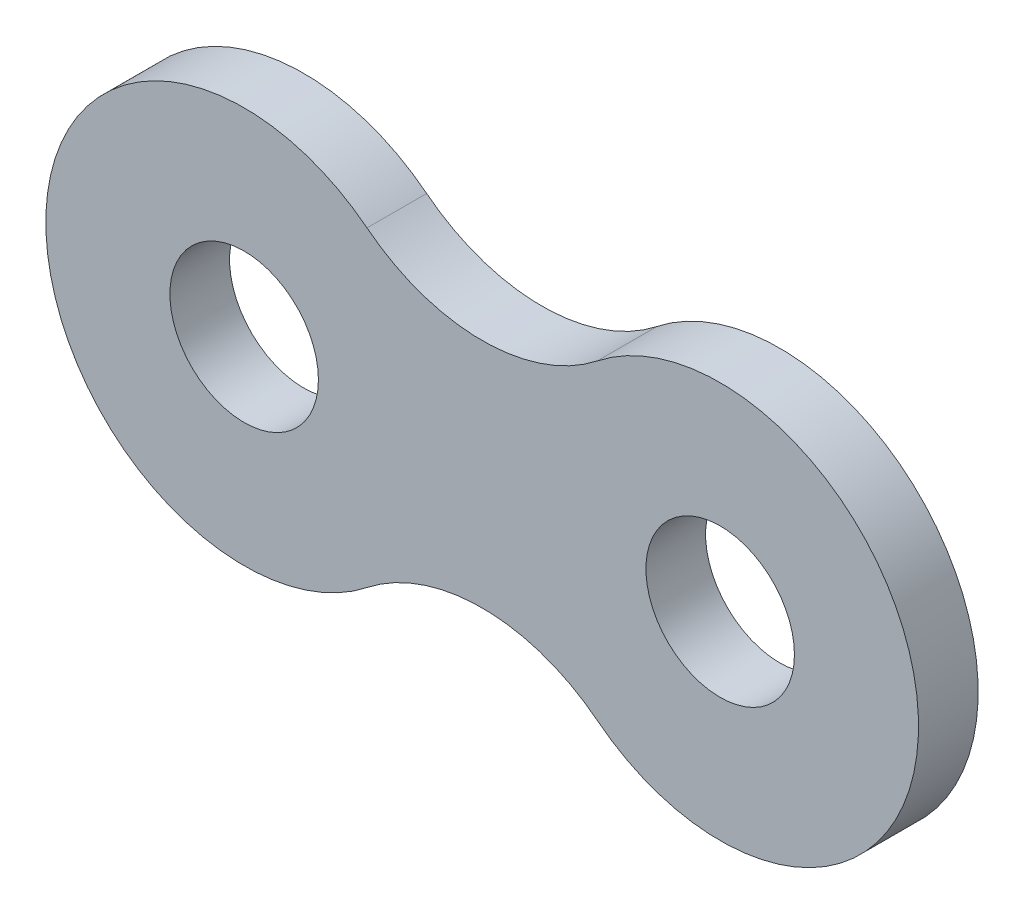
ISO-10303-21;
HEADER;
FILE_DESCRIPTION(('STEP AP214'),'2;1');
FILE_NAME('part.step','',(''),(''),'','','');
FILE_SCHEMA(('AUTOMOTIVE_DESIGN { 1 0 10303 214 1 1 1 1 }'));
ENDSEC;
DATA;
#1=APPLICATION_CONTEXT('core data for automotive mechanical design processes');
#2=APPLICATION_PROTOCOL_DEFINITION('international standard','automotive_design',2000,#1);
#3=PRODUCT_CONTEXT('',#1,'mechanical');
#4=PRODUCT('Part','Part','',(#3));
#5=PRODUCT_RELATED_PRODUCT_CATEGORY('part','',(#4));
#6=PRODUCT_DEFINITION_FORMATION('','',#4);
#7=PRODUCT_DEFINITION_CONTEXT('part definition',#1,'design');
#8=PRODUCT_DEFINITION('design','',#6,#7);
#9=PRODUCT_DEFINITION_SHAPE('','',#8);
#10=(LENGTH_UNIT() NAMED_UNIT(*) SI_UNIT(.MILLI.,.METRE.));
#11=(NAMED_UNIT(*) PLANE_ANGLE_UNIT() SI_UNIT($,.RADIAN.));
#12=(NAMED_UNIT(*) SI_UNIT($,.STERADIAN.) SOLID_ANGLE_UNIT());
#13=UNCERTAINTY_MEASURE_WITH_UNIT(LENGTH_MEASURE(1.E-05),#10,'distance_accuracy_value','');
#14=(GEOMETRIC_REPRESENTATION_CONTEXT(3) GLOBAL_UNCERTAINTY_ASSIGNED_CONTEXT((#13)) GLOBAL_UNIT_ASSIGNED_CONTEXT((#10,
#11,#12)) REPRESENTATION_CONTEXT('',''));
#15=CARTESIAN_POINT('',(0.,0.,0.));
#16=DIRECTION('',(0.,0.,1.));
#17=DIRECTION('',(1.,0.,0.));
#18=AXIS2_PLACEMENT_3D('',#15,#16,#17);
#19=CARTESIAN_POINT('',(4.7625,-6.03778091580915,2.3876));
#20=DIRECTION('',(0.,0.,1.));
#21=DIRECTION('',(1.,0.,0.));
#22=AXIS2_PLACEMENT_3D('',#19,#20,#21);
#23=PLANE('',#22);
#24=CARTESIAN_POINT('',(0.,0.,2.3876));
#25=DIRECTION('',(0.,0.,1.));
#26=DIRECTION('',(1.,0.,0.));
#27=AXIS2_PLACEMENT_3D('',#24,#25,#26);
#28=CIRCLE('',#27,2.9718);
#29=CARTESIAN_POINT('',(2.9718,0.,2.3876));
#30=VERTEX_POINT('',#29);
#31=EDGE_CURVE('E103',#30,#30,#28,.T.);
#32=ORIENTED_EDGE('',*,*,#31,.F.);
#33=EDGE_LOOP('',(#32));
#34=FACE_BOUND('',#33,.T.);
#35=CARTESIAN_POINT('',(0.,0.,2.3876));
#36=DIRECTION('',(0.,0.,1.));
#37=DIRECTION('',(1.,0.,0.));
#38=AXIS2_PLACEMENT_3D('',#35,#36,#37);
#39=CIRCLE('',#38,7.9375);
#40=CARTESIAN_POINT('',(4.9157750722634,6.23209930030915,2.3876));
#41=VERTEX_POINT('',#40);
#42=CARTESIAN_POINT('',(4.9157750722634,-6.23209930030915,2.3876));
#43=VERTEX_POINT('',#42);
#44=EDGE_CURVE('E88',#41,#43,#39,.T.);
#45=ORIENTED_EDGE('',*,*,#44,.T.);
#46=CARTESIAN_POINT('',(9.525,-12.0755618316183,2.3876));
#47=DIRECTION('',(0.,0.,-1.));
#48=DIRECTION('',(-1.,0.,0.));
#49=AXIS2_PLACEMENT_3D('',#46,#47,#48);
#50=CIRCLE('',#49,7.44251360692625);
#51=CARTESIAN_POINT('',(14.1342249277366,-6.23209930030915,2.3876));
#52=VERTEX_POINT('',#51);
#53=EDGE_CURVE('E83',#43,#52,#50,.T.);
#54=ORIENTED_EDGE('',*,*,#53,.T.);
#55=CARTESIAN_POINT('',(19.05,0.,2.3876));
#56=DIRECTION('',(0.,0.,1.));
#57=DIRECTION('',(1.,0.,0.));
#58=AXIS2_PLACEMENT_3D('',#55,#56,#57);
#59=CIRCLE('',#58,7.9375);
#60=CARTESIAN_POINT('',(14.1342249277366,6.23209930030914,2.3876));
#61=VERTEX_POINT('',#60);
#62=EDGE_CURVE('E86',#52,#61,#59,.T.);
#63=ORIENTED_EDGE('',*,*,#62,.T.);
#64=CARTESIAN_POINT('',(9.525,12.0755618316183,2.3876));
#65=DIRECTION('',(0.,0.,-1.));
#66=DIRECTION('',(1.,0.,0.));
#67=AXIS2_PLACEMENT_3D('',#64,#65,#66);
#68=CIRCLE('',#67,7.44251360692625);
#69=EDGE_CURVE('E53',#61,#41,#68,.T.);
#70=ORIENTED_EDGE('',*,*,#69,.T.);
#71=EDGE_LOOP('',(#45,#54,#63,#70));
#72=FACE_BOUND('',#71,.T.);
#73=CARTESIAN_POINT('',(19.05,0.,2.3876));
#74=DIRECTION('',(0.,0.,1.));
#75=DIRECTION('',(1.,0.,0.));
#76=AXIS2_PLACEMENT_3D('',#73,#74,#75);
#77=CIRCLE('',#76,2.9718);
#78=CARTESIAN_POINT('',(22.0218,0.,2.3876));
#79=VERTEX_POINT('',#78);
#80=EDGE_CURVE('E118',#79,#79,#77,.T.);
#81=ORIENTED_EDGE('',*,*,#80,.F.);
#82=EDGE_LOOP('',(#81));
#83=FACE_BOUND('',#82,.T.);
#84=ADVANCED_FACE('F36',(#34,#72,#83),#23,.T.);
#85=CARTESIAN_POINT('',(4.7625,-6.03778091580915,0.));
#86=DIRECTION('',(0.,0.,1.));
#87=DIRECTION('',(1.,0.,0.));
#88=AXIS2_PLACEMENT_3D('',#85,#86,#87);
#89=PLANE('',#88);
#90=CARTESIAN_POINT('',(0.,0.,0.));
#91=DIRECTION('',(0.,0.,1.));
#92=DIRECTION('',(1.,0.,0.));
#93=AXIS2_PLACEMENT_3D('',#90,#91,#92);
#94=CIRCLE('',#93,2.9718);
#95=CARTESIAN_POINT('',(2.9718,0.,0.));
#96=VERTEX_POINT('',#95);
#97=EDGE_CURVE('E115',#96,#96,#94,.T.);
#98=ORIENTED_EDGE('',*,*,#97,.T.);
#99=EDGE_LOOP('',(#98));
#100=FACE_BOUND('',#99,.T.);
#101=CARTESIAN_POINT('',(0.,0.,0.));
#102=DIRECTION('',(0.,0.,1.));
#103=DIRECTION('',(1.,0.,0.));
#104=AXIS2_PLACEMENT_3D('',#101,#102,#103);
#105=CIRCLE('',#104,7.9375);
#106=CARTESIAN_POINT('',(4.9157750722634,6.23209930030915,0.));
#107=VERTEX_POINT('',#106);
#108=CARTESIAN_POINT('',(4.9157750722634,-6.23209930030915,0.));
#109=VERTEX_POINT('',#108);
#110=EDGE_CURVE('E100',#107,#109,#105,.T.);
#111=ORIENTED_EDGE('',*,*,#110,.F.);
#112=CARTESIAN_POINT('',(9.525,12.0755618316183,0.));
#113=DIRECTION('',(0.,0.,-1.));
#114=DIRECTION('',(1.,0.,0.));
#115=AXIS2_PLACEMENT_3D('',#112,#113,#114);
#116=CIRCLE('',#115,7.44251360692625);
#117=CARTESIAN_POINT('',(14.1342249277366,6.23209930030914,0.));
#118=VERTEX_POINT('',#117);
#119=EDGE_CURVE('E76',#118,#107,#116,.T.);
#120=ORIENTED_EDGE('',*,*,#119,.F.);
#121=CARTESIAN_POINT('',(19.05,0.,0.));
#122=DIRECTION('',(0.,0.,1.));
#123=DIRECTION('',(1.,0.,0.));
#124=AXIS2_PLACEMENT_3D('',#121,#122,#123);
#125=CIRCLE('',#124,7.9375);
#126=CARTESIAN_POINT('',(14.1342249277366,-6.23209930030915,0.));
#127=VERTEX_POINT('',#126);
#128=EDGE_CURVE('E70',#127,#118,#125,.T.);
#129=ORIENTED_EDGE('',*,*,#128,.F.);
#130=CARTESIAN_POINT('',(9.525,-12.0755618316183,0.));
#131=DIRECTION('',(0.,0.,-1.));
#132=DIRECTION('',(-1.,0.,0.));
#133=AXIS2_PLACEMENT_3D('',#130,#131,#132);
#134=CIRCLE('',#133,7.44251360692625);
#135=EDGE_CURVE('E92',#109,#127,#134,.T.);
#136=ORIENTED_EDGE('',*,*,#135,.F.);
#137=EDGE_LOOP('',(#111,#120,#129,#136));
#138=FACE_BOUND('',#137,.T.);
#139=CARTESIAN_POINT('',(19.05,0.,0.));
#140=DIRECTION('',(0.,0.,1.));
#141=DIRECTION('',(1.,0.,0.));
#142=AXIS2_PLACEMENT_3D('',#139,#140,#141);
#143=CIRCLE('',#142,2.9718);
#144=CARTESIAN_POINT('',(22.0218,0.,0.));
#145=VERTEX_POINT('',#144);
#146=EDGE_CURVE('E121',#145,#145,#143,.T.);
#147=ORIENTED_EDGE('',*,*,#146,.T.);
#148=EDGE_LOOP('',(#147));
#149=FACE_BOUND('',#148,.T.);
#150=ADVANCED_FACE('F111',(#100,#138,#149),#89,.F.);
#151=CARTESIAN_POINT('',(0.,0.,2.3876));
#152=DIRECTION('',(0.,0.,-1.));
#153=DIRECTION('',(-1.,0.,0.));
#154=AXIS2_PLACEMENT_3D('',#151,#152,#153);
#155=CYLINDRICAL_SURFACE('',#154,7.9375);
#156=ORIENTED_EDGE('',*,*,#110,.T.);
#157=DIRECTION('',(0.,0.,-1.));
#158=VECTOR('',#157,1.);
#159=CARTESIAN_POINT('',(4.9157750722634,-6.23209930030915,2.3876));
#160=LINE('',#159,#158);
#161=EDGE_CURVE('E11',#43,#109,#160,.T.);
#162=ORIENTED_EDGE('',*,*,#161,.F.);
#163=ORIENTED_EDGE('',*,*,#44,.F.);
#164=DIRECTION('',(0.,0.,-1.));
#165=VECTOR('',#164,1.);
#166=CARTESIAN_POINT('',(4.9157750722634,6.23209930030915,2.3876));
#167=LINE('',#166,#165);
#168=EDGE_CURVE('E96',#41,#107,#167,.T.);
#169=ORIENTED_EDGE('',*,*,#168,.T.);
#170=EDGE_LOOP('',(#156,#162,#163,#169));
#171=FACE_BOUND('',#170,.T.);
#172=ADVANCED_FACE('F38',(#171),#155,.T.);
#173=CARTESIAN_POINT('',(9.525,-12.0755618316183,2.3876));
#174=DIRECTION('',(0.,0.,-1.));
#175=DIRECTION('',(-1.,0.,0.));
#176=AXIS2_PLACEMENT_3D('',#173,#174,#175);
#177=CYLINDRICAL_SURFACE('',#176,7.44251360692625);
#178=ORIENTED_EDGE('',*,*,#135,.T.);
#179=DIRECTION('',(0.,0.,-1.));
#180=VECTOR('',#179,1.);
#181=CARTESIAN_POINT('',(14.1342249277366,-6.23209930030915,2.3876));
#182=LINE('',#181,#180);
#183=EDGE_CURVE('E45',#52,#127,#182,.T.);
#184=ORIENTED_EDGE('',*,*,#183,.F.);
#185=ORIENTED_EDGE('',*,*,#53,.F.);
#186=ORIENTED_EDGE('',*,*,#161,.T.);
#187=EDGE_LOOP('',(#178,#184,#185,#186));
#188=FACE_BOUND('',#187,.T.);
#189=ADVANCED_FACE('F91',(#188),#177,.F.);
#190=CARTESIAN_POINT('',(19.05,0.,2.3876));
#191=DIRECTION('',(0.,0.,-1.));
#192=DIRECTION('',(-1.,0.,0.));
#193=AXIS2_PLACEMENT_3D('',#190,#191,#192);
#194=CYLINDRICAL_SURFACE('',#193,7.9375);
#195=ORIENTED_EDGE('',*,*,#128,.T.);
#196=DIRECTION('',(0.,0.,-1.));
#197=VECTOR('',#196,1.);
#198=CARTESIAN_POINT('',(14.1342249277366,6.23209930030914,2.3876));
#199=LINE('',#198,#197);
#200=EDGE_CURVE('E93',#61,#118,#199,.T.);
#201=ORIENTED_EDGE('',*,*,#200,.F.);
#202=ORIENTED_EDGE('',*,*,#62,.F.);
#203=ORIENTED_EDGE('',*,*,#183,.T.);
#204=EDGE_LOOP('',(#195,#201,#202,#203));
#205=FACE_BOUND('',#204,.T.);
#206=ADVANCED_FACE('F94',(#205),#194,.T.);
#207=CARTESIAN_POINT('',(9.525,12.0755618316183,2.3876));
#208=DIRECTION('',(0.,0.,-1.));
#209=DIRECTION('',(-1.,0.,0.));
#210=AXIS2_PLACEMENT_3D('',#207,#208,#209);
#211=CYLINDRICAL_SURFACE('',#210,7.44251360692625);
#212=ORIENTED_EDGE('',*,*,#119,.T.);
#213=ORIENTED_EDGE('',*,*,#168,.F.);
#214=ORIENTED_EDGE('',*,*,#69,.F.);
#215=ORIENTED_EDGE('',*,*,#200,.T.);
#216=EDGE_LOOP('',(#212,#213,#214,#215));
#217=FACE_BOUND('',#216,.T.);
#218=ADVANCED_FACE('F108',(#217),#211,.F.);
#219=CARTESIAN_POINT('',(0.,0.,2.3876));
#220=DIRECTION('',(0.,0.,-1.));
#221=DIRECTION('',(-1.,0.,0.));
#222=AXIS2_PLACEMENT_3D('',#219,#220,#221);
#223=CYLINDRICAL_SURFACE('',#222,2.9718);
#224=ORIENTED_EDGE('',*,*,#31,.T.);
#225=EDGE_LOOP('',(#224));
#226=FACE_BOUND('',#225,.T.);
#227=ORIENTED_EDGE('',*,*,#97,.F.);
#228=EDGE_LOOP('',(#227));
#229=FACE_BOUND('',#228,.T.);
#230=ADVANCED_FACE('F139',(#226,#229),#223,.F.);
#231=CARTESIAN_POINT('',(19.05,0.,2.3876));
#232=DIRECTION('',(0.,0.,-1.));
#233=DIRECTION('',(-1.,0.,0.));
#234=AXIS2_PLACEMENT_3D('',#231,#232,#233);
#235=CYLINDRICAL_SURFACE('',#234,2.9718);
#236=ORIENTED_EDGE('',*,*,#80,.T.);
#237=EDGE_LOOP('',(#236));
#238=FACE_BOUND('',#237,.T.);
#239=ORIENTED_EDGE('',*,*,#146,.F.);
#240=EDGE_LOOP('',(#239));
#241=FACE_BOUND('',#240,.T.);
#242=ADVANCED_FACE('F127',(#238,#241),#235,.F.);
#243=CLOSED_SHELL('',(#84,#150,#172,#189,#206,#218,#230,#242));
#244=MANIFOLD_SOLID_BREP('B2',#243);
#245=ADVANCED_BREP_SHAPE_REPRESENTATION('',(#18,#244),#14);
#246=SHAPE_DEFINITION_REPRESENTATION(#9,#245);
ENDSEC;
END-ISO-10303-21;
